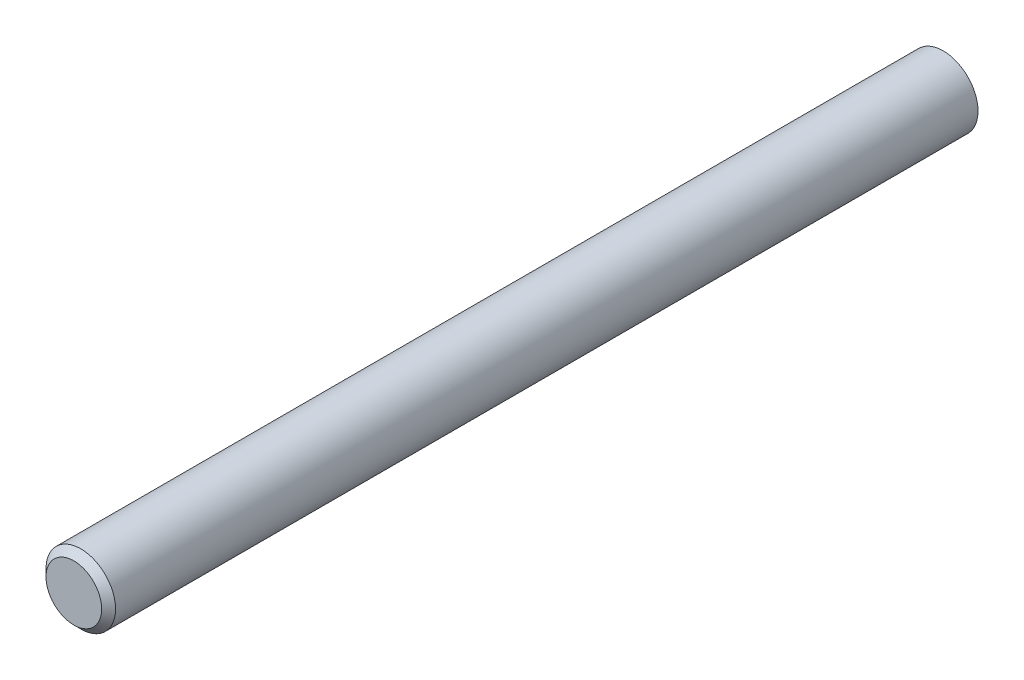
ISO-10303-21;
HEADER;
FILE_DESCRIPTION(('STEP AP214'),'2;1');
FILE_NAME('part.step','',(''),(''),'','','');
FILE_SCHEMA(('AUTOMOTIVE_DESIGN { 1 0 10303 214 1 1 1 1 }'));
ENDSEC;
DATA;
#1=APPLICATION_CONTEXT('core data for automotive mechanical design processes');
#2=APPLICATION_PROTOCOL_DEFINITION('international standard','automotive_design',2000,#1);
#3=PRODUCT_CONTEXT('',#1,'mechanical');
#4=PRODUCT('Part','Part','',(#3));
#5=PRODUCT_RELATED_PRODUCT_CATEGORY('part','',(#4));
#6=PRODUCT_DEFINITION_FORMATION('','',#4);
#7=PRODUCT_DEFINITION_CONTEXT('part definition',#1,'design');
#8=PRODUCT_DEFINITION('design','',#6,#7);
#9=PRODUCT_DEFINITION_SHAPE('','',#8);
#10=(LENGTH_UNIT() NAMED_UNIT(*) SI_UNIT(.MILLI.,.METRE.));
#11=(NAMED_UNIT(*) PLANE_ANGLE_UNIT() SI_UNIT($,.RADIAN.));
#12=(NAMED_UNIT(*) SI_UNIT($,.STERADIAN.) SOLID_ANGLE_UNIT());
#13=UNCERTAINTY_MEASURE_WITH_UNIT(LENGTH_MEASURE(1.E-05),#10,'distance_accuracy_value','');
#14=(GEOMETRIC_REPRESENTATION_CONTEXT(3) GLOBAL_UNCERTAINTY_ASSIGNED_CONTEXT((#13)) GLOBAL_UNIT_ASSIGNED_CONTEXT((#10,
#11,#12)) REPRESENTATION_CONTEXT('',''));
#15=CARTESIAN_POINT('',(0.,0.,0.));
#16=DIRECTION('',(0.,0.,1.));
#17=DIRECTION('',(1.,0.,0.));
#18=AXIS2_PLACEMENT_3D('',#15,#16,#17);
#19=CARTESIAN_POINT('',(0.,0.,25.));
#20=DIRECTION('',(0.,0.,-1.));
#21=DIRECTION('',(-1.,0.,0.));
#22=AXIS2_PLACEMENT_3D('',#19,#20,#21);
#23=CYLINDRICAL_SURFACE('',#22,2.);
#24=CARTESIAN_POINT('',(0.,0.,24.6));
#25=DIRECTION('',(0.,0.,1.));
#26=DIRECTION('',(1.,0.,0.));
#27=AXIS2_PLACEMENT_3D('',#24,#25,#26);
#28=CIRCLE('',#27,2.);
#29=CARTESIAN_POINT('',(2.,0.,24.6));
#30=VERTEX_POINT('',#29);
#31=EDGE_CURVE('E10',#30,#30,#28,.F.);
#32=ORIENTED_EDGE('',*,*,#31,.T.);
#33=EDGE_LOOP('',(#32));
#34=FACE_BOUND('',#33,.T.);
#35=CARTESIAN_POINT('',(0.,0.,-25.));
#36=DIRECTION('',(0.,0.,1.));
#37=DIRECTION('',(1.,0.,0.));
#38=AXIS2_PLACEMENT_3D('',#35,#36,#37);
#39=CIRCLE('',#38,2.);
#40=CARTESIAN_POINT('',(2.,0.,-25.));
#41=VERTEX_POINT('',#40);
#42=EDGE_CURVE('E41',#41,#41,#39,.T.);
#43=ORIENTED_EDGE('',*,*,#42,.T.);
#44=EDGE_LOOP('',(#43));
#45=FACE_BOUND('',#44,.T.);
#46=ADVANCED_FACE('F30',(#34,#45),#23,.T.);
#47=CARTESIAN_POINT('',(0.,0.,25.));
#48=DIRECTION('',(0.,0.,1.));
#49=DIRECTION('',(1.,0.,0.));
#50=AXIS2_PLACEMENT_3D('',#47,#48,#49);
#51=PLANE('',#50);
#52=CARTESIAN_POINT('',(0.,0.,25.));
#53=DIRECTION('',(0.,0.,1.));
#54=DIRECTION('',(1.,0.,0.));
#55=AXIS2_PLACEMENT_3D('',#52,#53,#54);
#56=CIRCLE('',#55,1.6);
#57=CARTESIAN_POINT('',(1.6,0.,25.));
#58=VERTEX_POINT('',#57);
#59=EDGE_CURVE('E37',#58,#58,#56,.T.);
#60=ORIENTED_EDGE('',*,*,#59,.T.);
#61=EDGE_LOOP('',(#60));
#62=FACE_BOUND('',#61,.T.);
#63=ADVANCED_FACE('F51',(#62),#51,.T.);
#64=CARTESIAN_POINT('',(0.,0.,-25.));
#65=DIRECTION('',(0.,0.,1.));
#66=DIRECTION('',(1.,0.,0.));
#67=AXIS2_PLACEMENT_3D('',#64,#65,#66);
#68=PLANE('',#67);
#69=ORIENTED_EDGE('',*,*,#42,.F.);
#70=EDGE_LOOP('',(#69));
#71=FACE_BOUND('',#70,.T.);
#72=ADVANCED_FACE('F49',(#71),#68,.F.);
#73=CARTESIAN_POINT('',(0.,0.,25.));
#74=DIRECTION('',(0.,0.,-1.));
#75=DIRECTION('',(-1.,0.,0.));
#76=AXIS2_PLACEMENT_3D('',#73,#74,#75);
#77=CONICAL_SURFACE('',#76,1.6,0.78539816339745);
#78=ORIENTED_EDGE('',*,*,#31,.F.);
#79=EDGE_LOOP('',(#78));
#80=FACE_BOUND('',#79,.T.);
#81=ORIENTED_EDGE('',*,*,#59,.F.);
#82=EDGE_LOOP('',(#81));
#83=FACE_BOUND('',#82,.T.);
#84=ADVANCED_FACE('F32',(#80,#83),#77,.T.);
#85=CLOSED_SHELL('',(#46,#63,#72,#84));
#86=MANIFOLD_SOLID_BREP('B2',#85);
#87=ADVANCED_BREP_SHAPE_REPRESENTATION('',(#18,#86),#14);
#88=SHAPE_DEFINITION_REPRESENTATION(#9,#87);
ENDSEC;
END-ISO-10303-21;
